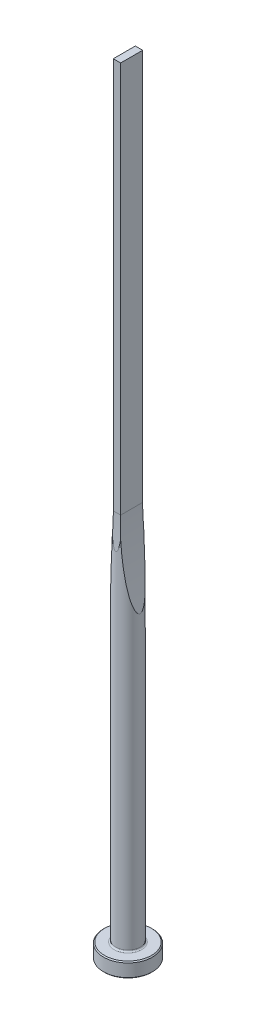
from build123d import *

# Parameters (mm, degrees)
CUT_EXTRUDE1_DEPTH = 5
CUT_EXTRUDE2_DEPTH = 5


with BuildPart() as part:
    # Sketch1 → Revolve1 (revolve)
    with BuildSketch(Plane.XY, mode=Mode.PRIVATE) as revolve1_sk:
        with BuildLine():
            Line((0, 0), (4.8, 0))
            Line((4.8, 0), (5, 0.2))
            Line((5, 0.2), (5, 2.8))
            Line((5, 2.8), (4.8, 3))
            Line((4.8, 3), (2.8, 3))
            ThreePointArc((2.8, 3), (2.587867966, 3.087867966), (2.5, 3.3))
            Line((2.5, 3.3), (2.5, 160))
            Line((2.5, 160), (0, 160))
            Line((0, 160), (0, 0))
        make_face()
    revolve(revolve1_sk.sketch.rotate(Axis((0, 160, 0), (0, -1, 0)), 180), axis=Axis((0, 160, 0), (0, -1, 0)))

    # Sketch2 → Cut-Extrude1 (cut, symmetric)
    with BuildSketch(Plane.XY):
        with BuildLine():
            Line((0.75, 160), (0.75, 80))
            ThreePointArc((0.75, 80), (1.188568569, 71.125880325), (2.5, 62.338247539))
            Line((2.5, 62.338247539), (2.5, 160))
            Line((2.5, 160), (0.75, 160))
        make_face()
        with BuildLine():
            Line((-0.75, 160), (-0.75, 80))
            ThreePointArc((-0.75, 80), (-1.188568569, 71.125880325), (-2.5, 62.338247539))
            Line((-2.5, 62.338247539), (-2.5, 160))
            Line((-2.5, 160), (-0.75, 160))
        make_face()
    extrude(amount=CUT_EXTRUDE1_DEPTH, both=True, mode=Mode.SUBTRACT)

    # Sketch3 → Cut-Extrude2 (cut, symmetric)
    with BuildSketch(Plane(origin=(0, 0, 0), x_dir=(0, 0, -1), z_dir=(1, 0, 0))):
        with BuildLine():
            Line((2.25, 160), (2.25, 80))
            ThreePointArc((2.25, 80), (2.312521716, 76.645898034), (2.5, 73.296456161))
            Line((2.5, 73.296456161), (2.5, 160))
            Line((2.5, 160), (2.25, 160))
        make_face()
        with BuildLine():
            Line((-2.25, 160), (-2.25, 80))
            ThreePointArc((-2.25, 80), (-2.312521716, 76.645898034), (-2.5, 73.296456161))
            Line((-2.5, 73.296456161), (-2.5, 160))
            Line((-2.5, 160), (-2.25, 160))
        make_face()
    extrude(amount=CUT_EXTRUDE2_DEPTH, both=True, mode=Mode.SUBTRACT)


solid = part.part
